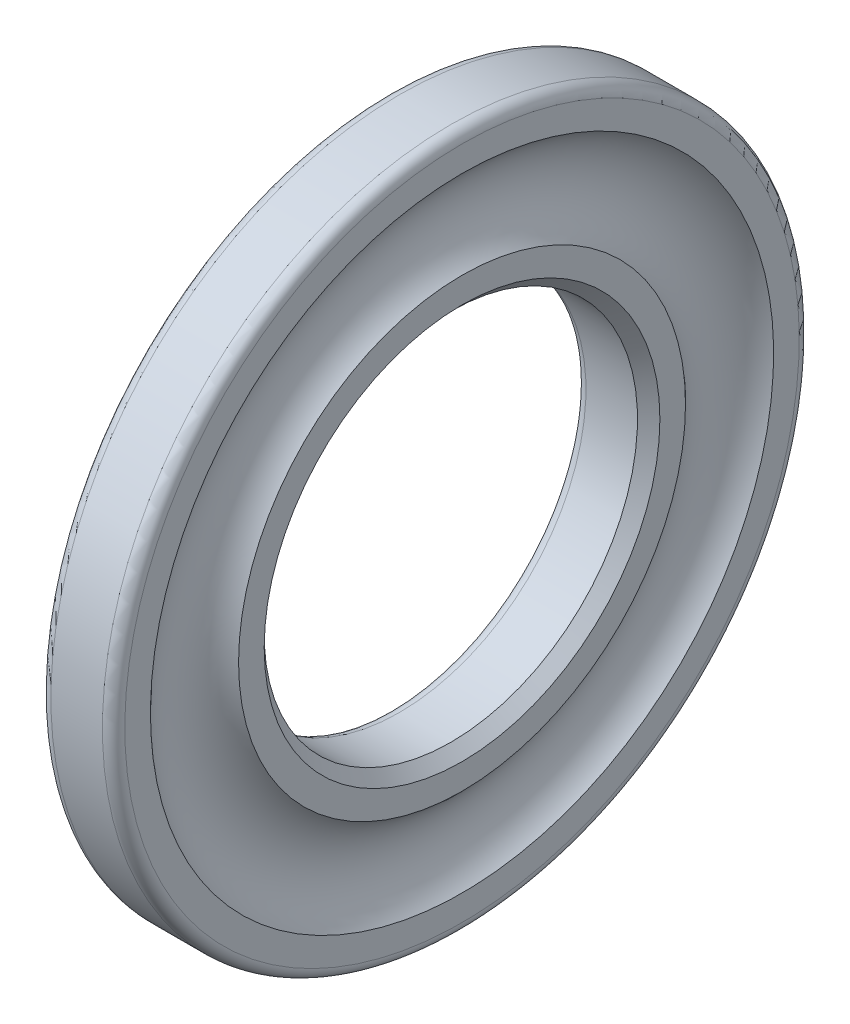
ISO-10303-21;
HEADER;
FILE_DESCRIPTION(('STEP AP214'),'2;1');
FILE_NAME('part.step','',(''),(''),'','','');
FILE_SCHEMA(('AUTOMOTIVE_DESIGN { 1 0 10303 214 1 1 1 1 }'));
ENDSEC;
DATA;
#1=APPLICATION_CONTEXT('core data for automotive mechanical design processes');
#2=APPLICATION_PROTOCOL_DEFINITION('international standard','automotive_design',2000,#1);
#3=PRODUCT_CONTEXT('',#1,'mechanical');
#4=PRODUCT('Part','Part','',(#3));
#5=PRODUCT_RELATED_PRODUCT_CATEGORY('part','',(#4));
#6=PRODUCT_DEFINITION_FORMATION('','',#4);
#7=PRODUCT_DEFINITION_CONTEXT('part definition',#1,'design');
#8=PRODUCT_DEFINITION('design','',#6,#7);
#9=PRODUCT_DEFINITION_SHAPE('','',#8);
#10=(LENGTH_UNIT() NAMED_UNIT(*) SI_UNIT(.MILLI.,.METRE.));
#11=(NAMED_UNIT(*) PLANE_ANGLE_UNIT() SI_UNIT($,.RADIAN.));
#12=(NAMED_UNIT(*) SI_UNIT($,.STERADIAN.) SOLID_ANGLE_UNIT());
#13=UNCERTAINTY_MEASURE_WITH_UNIT(LENGTH_MEASURE(1.E-05),#10,'distance_accuracy_value','');
#14=(GEOMETRIC_REPRESENTATION_CONTEXT(3) GLOBAL_UNCERTAINTY_ASSIGNED_CONTEXT((#13)) GLOBAL_UNIT_ASSIGNED_CONTEXT((#10,
#11,#12)) REPRESENTATION_CONTEXT('',''));
#15=CARTESIAN_POINT('',(0.,0.,0.));
#16=DIRECTION('',(0.,0.,1.));
#17=DIRECTION('',(1.,0.,0.));
#18=AXIS2_PLACEMENT_3D('',#15,#16,#17);
#19=CARTESIAN_POINT('',(0.,10.75,0.));
#20=DIRECTION('',(-1.,0.,0.));
#21=DIRECTION('',(0.,0.,1.));
#22=AXIS2_PLACEMENT_3D('',#19,#20,#21);
#23=PLANE('',#22);
#24=CARTESIAN_POINT('',(0.,0.,0.));
#25=DIRECTION('',(-1.,0.,0.));
#26=DIRECTION('',(0.,1.,0.));
#27=AXIS2_PLACEMENT_3D('',#24,#25,#26);
#28=CIRCLE('',#27,7.95);
#29=CARTESIAN_POINT('',(0.,7.95,0.));
#30=VERTEX_POINT('',#29);
#31=EDGE_CURVE('E81',#30,#30,#28,.T.);
#32=ORIENTED_EDGE('',*,*,#31,.F.);
#33=EDGE_LOOP('',(#32));
#34=FACE_BOUND('',#33,.T.);
#35=CARTESIAN_POINT('',(0.,0.,0.));
#36=DIRECTION('',(-1.,0.,0.));
#37=DIRECTION('',(0.,1.,0.));
#38=AXIS2_PLACEMENT_3D('',#35,#36,#37);
#39=CIRCLE('',#38,13.55);
#40=CARTESIAN_POINT('',(0.,13.55,0.));
#41=VERTEX_POINT('',#40);
#42=EDGE_CURVE('E10',#41,#41,#39,.T.);
#43=ORIENTED_EDGE('',*,*,#42,.T.);
#44=EDGE_LOOP('',(#43));
#45=FACE_BOUND('',#44,.T.);
#46=ADVANCED_FACE('F15',(#34,#45),#23,.T.);
#47=CARTESIAN_POINT('',(2.97,13.0352542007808,0.));
#48=DIRECTION('',(1.,0.,0.));
#49=DIRECTION('',(0.,1.,0.));
#50=AXIS2_PLACEMENT_3D('',#47,#48,#49);
#51=PLANE('',#50);
#52=CARTESIAN_POINT('',(2.97,0.,0.));
#53=DIRECTION('',(-1.,0.,0.));
#54=DIRECTION('',(0.,1.,0.));
#55=AXIS2_PLACEMENT_3D('',#52,#53,#54);
#56=CIRCLE('',#55,12.5205084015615);
#57=CARTESIAN_POINT('',(2.97,12.5205084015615,0.));
#58=VERTEX_POINT('',#57);
#59=EDGE_CURVE('E23',#58,#58,#56,.T.);
#60=ORIENTED_EDGE('',*,*,#59,.T.);
#61=EDGE_LOOP('',(#60));
#62=FACE_BOUND('',#61,.T.);
#63=CARTESIAN_POINT('',(2.97,0.,0.));
#64=DIRECTION('',(-1.,0.,0.));
#65=DIRECTION('',(0.,1.,0.));
#66=AXIS2_PLACEMENT_3D('',#63,#64,#65);
#67=CIRCLE('',#66,13.55);
#68=CARTESIAN_POINT('',(2.97,13.55,0.));
#69=VERTEX_POINT('',#68);
#70=EDGE_CURVE('E87',#69,#69,#67,.T.);
#71=ORIENTED_EDGE('',*,*,#70,.F.);
#72=EDGE_LOOP('',(#71));
#73=FACE_BOUND('',#72,.T.);
#74=ADVANCED_FACE('F72',(#62,#73),#51,.T.);
#75=CARTESIAN_POINT('',(2.97,8.46474579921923,0.));
#76=DIRECTION('',(1.,0.,0.));
#77=DIRECTION('',(0.,0.,-1.));
#78=AXIS2_PLACEMENT_3D('',#75,#76,#77);
#79=PLANE('',#78);
#80=CARTESIAN_POINT('',(2.97,0.,0.));
#81=DIRECTION('',(-1.,0.,0.));
#82=DIRECTION('',(0.,1.,0.));
#83=AXIS2_PLACEMENT_3D('',#80,#81,#82);
#84=CIRCLE('',#83,7.95);
#85=CARTESIAN_POINT('',(2.97,7.95,0.));
#86=VERTEX_POINT('',#85);
#87=EDGE_CURVE('E28',#86,#86,#84,.T.);
#88=ORIENTED_EDGE('',*,*,#87,.T.);
#89=EDGE_LOOP('',(#88));
#90=FACE_BOUND('',#89,.T.);
#91=CARTESIAN_POINT('',(2.97,0.,0.));
#92=DIRECTION('',(-1.,0.,0.));
#93=DIRECTION('',(0.,1.,0.));
#94=AXIS2_PLACEMENT_3D('',#91,#92,#93);
#95=CIRCLE('',#94,8.97949159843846);
#96=CARTESIAN_POINT('',(2.97,8.97949159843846,0.));
#97=VERTEX_POINT('',#96);
#98=EDGE_CURVE('E82',#97,#97,#95,.T.);
#99=ORIENTED_EDGE('',*,*,#98,.F.);
#100=EDGE_LOOP('',(#99));
#101=FACE_BOUND('',#100,.T.);
#102=ADVANCED_FACE('F43',(#90,#101),#79,.T.);
#103=CARTESIAN_POINT('',(0.449999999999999,0.,0.));
#104=DIRECTION('',(-1.,0.,0.));
#105=DIRECTION('',(0.,0.,1.));
#106=AXIS2_PLACEMENT_3D('',#103,#104,#105);
#107=TOROIDAL_SURFACE('',#106,7.95,0.449999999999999);
#108=ORIENTED_EDGE('',*,*,#31,.T.);
#109=EDGE_LOOP('',(#108));
#110=FACE_BOUND('',#109,.T.);
#111=CARTESIAN_POINT('',(0.45,0.,0.));
#112=DIRECTION('',(-1.,0.,0.));
#113=DIRECTION('',(0.,1.,0.));
#114=AXIS2_PLACEMENT_3D('',#111,#112,#113);
#115=CIRCLE('',#114,7.5);
#116=CARTESIAN_POINT('',(0.45,7.5,0.));
#117=VERTEX_POINT('',#116);
#118=EDGE_CURVE('E100',#117,#117,#115,.T.);
#119=ORIENTED_EDGE('',*,*,#118,.F.);
#120=EDGE_LOOP('',(#119));
#121=FACE_BOUND('',#120,.T.);
#122=ADVANCED_FACE('F39',(#110,#121),#107,.T.);
#123=CARTESIAN_POINT('',(1.485,0.,0.));
#124=DIRECTION('',(-1.,0.,0.));
#125=DIRECTION('',(0.,0.,1.));
#126=AXIS2_PLACEMENT_3D('',#123,#124,#125);
#127=CYLINDRICAL_SURFACE('',#126,7.5);
#128=CARTESIAN_POINT('',(2.52,0.,0.));
#129=DIRECTION('',(-1.,0.,0.));
#130=DIRECTION('',(0.,1.,0.));
#131=AXIS2_PLACEMENT_3D('',#128,#129,#130);
#132=CIRCLE('',#131,7.5);
#133=CARTESIAN_POINT('',(2.52,7.5,0.));
#134=VERTEX_POINT('',#133);
#135=EDGE_CURVE('E32',#134,#134,#132,.T.);
#136=ORIENTED_EDGE('',*,*,#135,.F.);
#137=EDGE_LOOP('',(#136));
#138=FACE_BOUND('',#137,.T.);
#139=ORIENTED_EDGE('',*,*,#118,.T.);
#140=EDGE_LOOP('',(#139));
#141=FACE_BOUND('',#140,.T.);
#142=ADVANCED_FACE('F17',(#138,#141),#127,.F.);
#143=DIRECTION('',(0.707106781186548,0.707106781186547,0.));
#144=VECTOR('',#143,1.);
#145=CARTESIAN_POINT('',(2.745,7.725,0.));
#146=LINE('',#145,#144);
#147=CARTESIAN_POINT('',(-4.98000000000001,0.,0.));
#148=DIRECTION('',(1.,0.,0.));
#149=AXIS1_PLACEMENT('',#147,#148);
#150=SURFACE_OF_REVOLUTION('',#146,#149);
#151=ORIENTED_EDGE('',*,*,#87,.F.);
#152=EDGE_LOOP('',(#151));
#153=FACE_BOUND('',#152,.T.);
#154=ORIENTED_EDGE('',*,*,#135,.T.);
#155=EDGE_LOOP('',(#154));
#156=FACE_BOUND('',#155,.T.);
#157=ADVANCED_FACE('F46',(#153,#156),#150,.F.);
#158=CARTESIAN_POINT('',(4.5,0.,0.));
#159=DIRECTION('',(-1.,0.,0.));
#160=DIRECTION('',(0.,0.,1.));
#161=AXIS2_PLACEMENT_3D('',#158,#159,#160);
#162=TOROIDAL_SURFACE('',#161,10.75,2.34);
#163=ORIENTED_EDGE('',*,*,#98,.T.);
#164=EDGE_LOOP('',(#163));
#165=FACE_BOUND('',#164,.T.);
#166=ORIENTED_EDGE('',*,*,#59,.F.);
#167=EDGE_LOOP('',(#166));
#168=FACE_BOUND('',#167,.T.);
#169=ADVANCED_FACE('F49',(#165,#168),#162,.F.);
#170=CARTESIAN_POINT('',(2.52,0.,0.));
#171=DIRECTION('',(-1.,0.,0.));
#172=DIRECTION('',(0.,0.,1.));
#173=AXIS2_PLACEMENT_3D('',#170,#171,#172);
#174=TOROIDAL_SURFACE('',#173,13.55,0.45);
#175=ORIENTED_EDGE('',*,*,#70,.T.);
#176=EDGE_LOOP('',(#175));
#177=FACE_BOUND('',#176,.T.);
#178=CARTESIAN_POINT('',(2.52,0.,0.));
#179=DIRECTION('',(-1.,0.,0.));
#180=DIRECTION('',(0.,1.,0.));
#181=AXIS2_PLACEMENT_3D('',#178,#179,#180);
#182=CIRCLE('',#181,14.);
#183=CARTESIAN_POINT('',(2.52,14.,0.));
#184=VERTEX_POINT('',#183);
#185=EDGE_CURVE('E92',#184,#184,#182,.T.);
#186=ORIENTED_EDGE('',*,*,#185,.F.);
#187=EDGE_LOOP('',(#186));
#188=FACE_BOUND('',#187,.T.);
#189=ADVANCED_FACE('F53',(#177,#188),#174,.T.);
#190=CARTESIAN_POINT('',(1.485,0.,0.));
#191=DIRECTION('',(-1.,0.,0.));
#192=DIRECTION('',(0.,0.,1.));
#193=AXIS2_PLACEMENT_3D('',#190,#191,#192);
#194=CYLINDRICAL_SURFACE('',#193,14.);
#195=CARTESIAN_POINT('',(0.45,0.,0.));
#196=DIRECTION('',(-1.,0.,0.));
#197=DIRECTION('',(0.,1.,0.));
#198=AXIS2_PLACEMENT_3D('',#195,#196,#197);
#199=CIRCLE('',#198,14.);
#200=CARTESIAN_POINT('',(0.45,14.,0.));
#201=VERTEX_POINT('',#200);
#202=EDGE_CURVE('E91',#201,#201,#199,.T.);
#203=ORIENTED_EDGE('',*,*,#202,.F.);
#204=EDGE_LOOP('',(#203));
#205=FACE_BOUND('',#204,.T.);
#206=ORIENTED_EDGE('',*,*,#185,.T.);
#207=EDGE_LOOP('',(#206));
#208=FACE_BOUND('',#207,.T.);
#209=ADVANCED_FACE('F59',(#205,#208),#194,.T.);
#210=CARTESIAN_POINT('',(0.450000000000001,0.,0.));
#211=DIRECTION('',(-1.,0.,0.));
#212=DIRECTION('',(0.,0.,1.));
#213=AXIS2_PLACEMENT_3D('',#210,#211,#212);
#214=TOROIDAL_SURFACE('',#213,13.55,0.449999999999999);
#215=ORIENTED_EDGE('',*,*,#202,.T.);
#216=EDGE_LOOP('',(#215));
#217=FACE_BOUND('',#216,.T.);
#218=ORIENTED_EDGE('',*,*,#42,.F.);
#219=EDGE_LOOP('',(#218));
#220=FACE_BOUND('',#219,.T.);
#221=ADVANCED_FACE('F62',(#217,#220),#214,.T.);
#222=CLOSED_SHELL('',(#46,#74,#102,#122,#142,#157,#169,#189,#209,#221));
#223=MANIFOLD_SOLID_BREP('B1',#222);
#224=ADVANCED_BREP_SHAPE_REPRESENTATION('',(#18,#223),#14);
#225=SHAPE_DEFINITION_REPRESENTATION(#9,#224);
ENDSEC;
END-ISO-10303-21;
